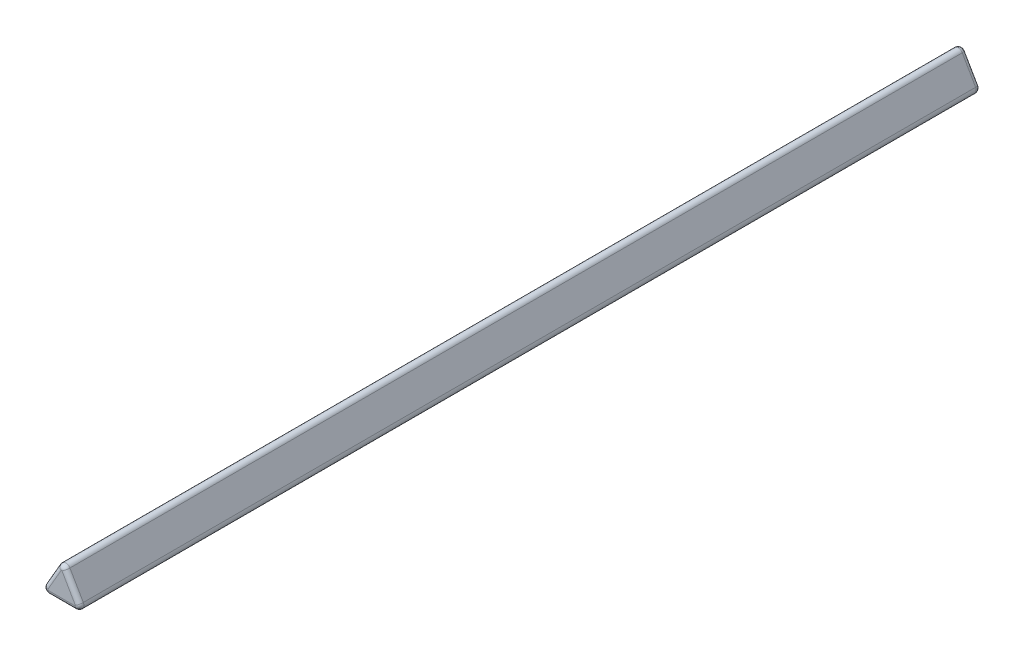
from build123d import *

# Parameters (mm, degrees)
EXTRUSION1_DEPTH = 105
CONG_1_R         = 0.5


with BuildPart() as part:
    # Esquisse1 → Extrusion1 (new body)
    with BuildSketch(Plane.XY):
        with BuildLine():
            Line((-0.476313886, 2.07500006), (-2.035159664, -0.625000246))
            ThreePointArc((-2.035159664, -0.625000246), (-2.03515965, -1.175000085), (-1.558845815, -1.45))
            Line((-1.558845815, -1.45), (1.558845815, -1.45))
            ThreePointArc((1.558845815, -1.45), (2.035159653, -1.17500008), (2.035159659, -0.625000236))
            Line((2.035159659, -0.625000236), (0.476313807, 2.07500007))
            ThreePointArc((0.476313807, 2.07500007), (-4.2e-08, 2.35), (-0.476313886, 2.07500006))
        make_face()
    extrude(amount=EXTRUSION1_DEPTH)

    # Cong_1
    cong_1_edges = [part.edges().sort_by_distance(p)[0] for p in [
        (-4.2e-08, 2.35, 105),
        (-1.255736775, 0.724999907, 105),
        (-2.03515965, -1.175000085, 105),
        (0, -1.45, 105),
        (2.035159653, -1.17500008, 105),
        (0, -1.45, 0),
        (-2.03515965, -1.175000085, 0),
        (-1.255736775, 0.724999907, 0),
        (-4.2e-08, 2.35, 0),
        (1.255736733, 0.724999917, 105),
        (1.255736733, 0.724999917, 0),
        (2.035159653, -1.17500008, 0),
    ]]
    fillet(cong_1_edges, radius=CONG_1_R)


solid = part.part
